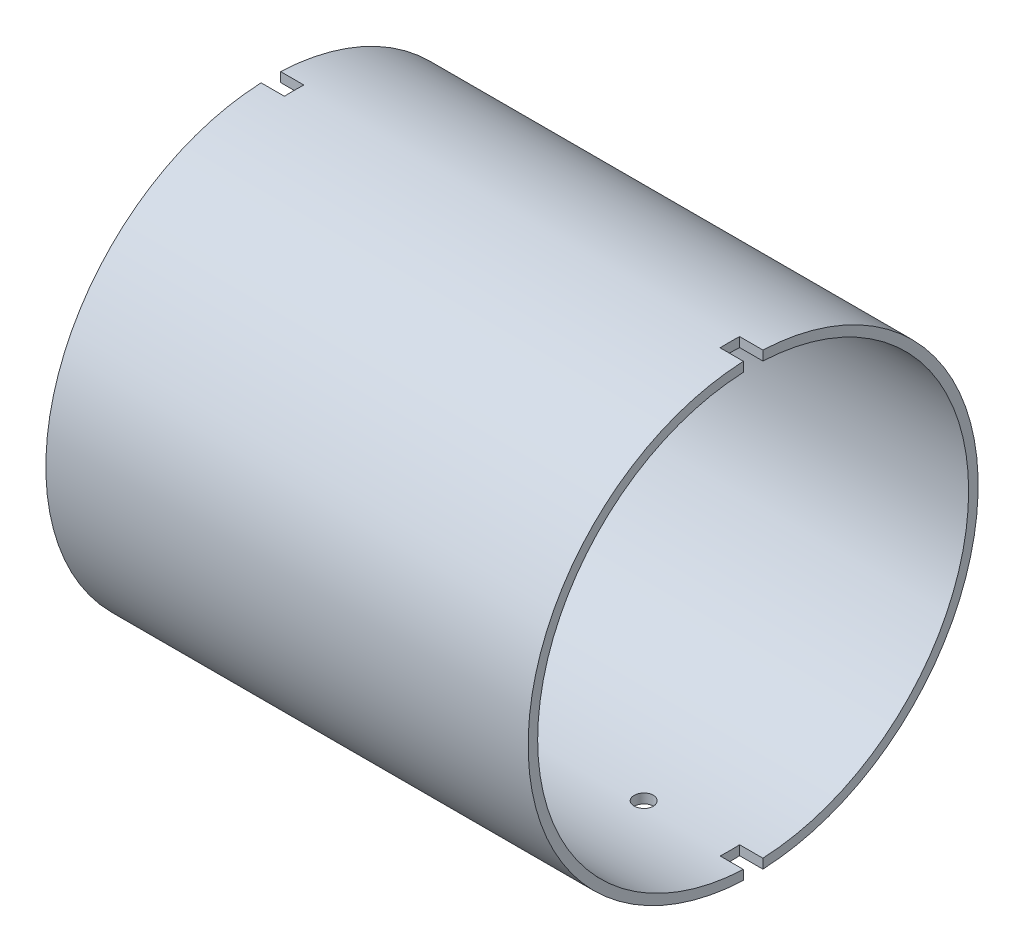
ISO-10303-21;
HEADER;
FILE_DESCRIPTION(('STEP AP214'),'2;1');
FILE_NAME('part.step','',(''),(''),'','','');
FILE_SCHEMA(('AUTOMOTIVE_DESIGN { 1 0 10303 214 1 1 1 1 }'));
ENDSEC;
DATA;
#1=APPLICATION_CONTEXT('core data for automotive mechanical design processes');
#2=APPLICATION_PROTOCOL_DEFINITION('international standard','automotive_design',2000,#1);
#3=PRODUCT_CONTEXT('',#1,'mechanical');
#4=PRODUCT('Part','Part','',(#3));
#5=PRODUCT_RELATED_PRODUCT_CATEGORY('part','',(#4));
#6=PRODUCT_DEFINITION_FORMATION('','',#4);
#7=PRODUCT_DEFINITION_CONTEXT('part definition',#1,'design');
#8=PRODUCT_DEFINITION('design','',#6,#7);
#9=PRODUCT_DEFINITION_SHAPE('','',#8);
#10=(LENGTH_UNIT() NAMED_UNIT(*) SI_UNIT(.MILLI.,.METRE.));
#11=(NAMED_UNIT(*) PLANE_ANGLE_UNIT() SI_UNIT($,.RADIAN.));
#12=(NAMED_UNIT(*) SI_UNIT($,.STERADIAN.) SOLID_ANGLE_UNIT());
#13=UNCERTAINTY_MEASURE_WITH_UNIT(LENGTH_MEASURE(1.E-05),#10,'distance_accuracy_value','');
#14=(GEOMETRIC_REPRESENTATION_CONTEXT(3) GLOBAL_UNCERTAINTY_ASSIGNED_CONTEXT((#13)) GLOBAL_UNIT_ASSIGNED_CONTEXT((#10,
#11,#12)) REPRESENTATION_CONTEXT('',''));
#15=CARTESIAN_POINT('',(0.,0.,0.));
#16=DIRECTION('',(0.,0.,1.));
#17=DIRECTION('',(1.,0.,0.));
#18=AXIS2_PLACEMENT_3D('',#15,#16,#17);
#19=CARTESIAN_POINT('',(0.,0.,0.));
#20=DIRECTION('',(1.,0.,0.));
#21=DIRECTION('',(0.,0.,-1.));
#22=AXIS2_PLACEMENT_3D('',#19,#20,#21);
#23=CYLINDRICAL_SURFACE('',#22,35.941);
#24=CARTESIAN_POINT('',(62.1792,-35.905923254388,-1.5875));
#25=CARTESIAN_POINT('',(62.2683238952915,-35.9059237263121,-1.58749606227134));
#26=CARTESIAN_POINT('',(62.3575113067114,-35.9062586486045,-1.57996953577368));
#27=CARTESIAN_POINT('',(62.5334266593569,-35.9075624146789,-1.55005096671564));
#28=CARTESIAN_POINT('',(62.6201515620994,-35.9085320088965,-1.52764132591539));
#29=CARTESIAN_POINT('',(62.7885680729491,-35.910995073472,-1.46859859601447));
#30=CARTESIAN_POINT('',(62.8702621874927,-35.9124882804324,-1.43197265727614));
#31=CARTESIAN_POINT('',(63.0263203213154,-35.9158299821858,-1.34554774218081));
#32=CARTESIAN_POINT('',(63.1006860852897,-35.9176783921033,-1.29575191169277));
#33=CARTESIAN_POINT('',(63.2400600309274,-35.9215239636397,-1.18435471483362));
#34=CARTESIAN_POINT('',(63.3050614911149,-35.9235212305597,-1.1227449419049));
#35=CARTESIAN_POINT('',(63.4238045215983,-35.9274384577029,-0.989485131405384));
#36=CARTESIAN_POINT('',(63.4775456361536,-35.9293584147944,-0.917834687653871));
#37=CARTESIAN_POINT('',(63.5722593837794,-35.9329053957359,-0.766494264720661));
#38=CARTESIAN_POINT('',(63.6132270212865,-35.9345323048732,-0.686801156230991));
#39=CARTESIAN_POINT('',(63.6811987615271,-35.9373088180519,-0.521659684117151));
#40=CARTESIAN_POINT('',(63.7082029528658,-35.938458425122,-0.436211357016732));
#41=CARTESIAN_POINT('',(63.7474641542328,-35.9401500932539,-0.262044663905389));
#42=CARTESIAN_POINT('',(63.7597308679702,-35.9406925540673,-0.173328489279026));
#43=CARTESIAN_POINT('',(63.7691988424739,-35.9411101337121,0.00490534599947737));
#44=CARTESIAN_POINT('',(63.7664002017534,-35.9409852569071,0.0944230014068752));
#45=CARTESIAN_POINT('',(63.7458249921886,-35.9400825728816,0.271653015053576));
#46=CARTESIAN_POINT('',(63.7280588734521,-35.9393052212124,0.359366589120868));
#47=CARTESIAN_POINT('',(63.6780692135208,-35.937185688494,0.530565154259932));
#48=CARTESIAN_POINT('',(63.6458456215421,-35.9358435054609,0.614050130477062));
#49=CARTESIAN_POINT('',(63.567843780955,-35.932744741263,0.77445533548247));
#50=CARTESIAN_POINT('',(63.5220607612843,-35.9309880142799,0.851373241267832));
#51=CARTESIAN_POINT('',(63.4182431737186,-35.9272580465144,0.996435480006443));
#52=CARTESIAN_POINT('',(63.3602085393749,-35.9252848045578,1.06457976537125));
#53=CARTESIAN_POINT('',(63.2334760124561,-35.9213420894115,1.19022132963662));
#54=CARTESIAN_POINT('',(63.1647690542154,-35.9193726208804,1.24770946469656));
#55=CARTESIAN_POINT('',(63.0186741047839,-35.9156611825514,1.35033642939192));
#56=CARTESIAN_POINT('',(62.9412861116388,-35.9139192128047,1.3954752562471));
#57=CARTESIAN_POINT('',(62.7800204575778,-35.9108593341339,1.47212141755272));
#58=CARTESIAN_POINT('',(62.696142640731,-35.9095414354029,1.50362842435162));
#59=CARTESIAN_POINT('',(62.5242807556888,-35.9074787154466,1.55211054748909));
#60=CARTESIAN_POINT('',(62.4362967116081,-35.9067338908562,1.56908574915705));
#61=CARTESIAN_POINT('',(62.2587995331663,-35.9059019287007,1.58801112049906));
#62=CARTESIAN_POINT('',(62.1692877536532,-35.9058142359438,1.58997397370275));
#63=CARTESIAN_POINT('',(61.9912060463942,-35.9063049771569,1.57885201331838));
#64=CARTESIAN_POINT('',(61.9026361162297,-35.9068834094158,1.56576723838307));
#65=CARTESIAN_POINT('',(61.728987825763,-35.9086406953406,1.52493196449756));
#66=CARTESIAN_POINT('',(61.6439081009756,-35.9098193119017,1.49718725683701));
#67=CARTESIAN_POINT('',(61.4796133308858,-35.9126439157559,1.42782555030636));
#68=CARTESIAN_POINT('',(61.4003983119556,-35.9142899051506,1.3862084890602));
#69=CARTESIAN_POINT('',(61.2500231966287,-35.9178650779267,1.29025082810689));
#70=CARTESIAN_POINT('',(61.1788685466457,-35.9197944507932,1.2359017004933));
#71=CARTESIAN_POINT('',(61.0466887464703,-35.9237182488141,1.11603515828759));
#72=CARTESIAN_POINT('',(60.9856636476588,-35.9257126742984,1.0505176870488));
#73=CARTESIAN_POINT('',(60.875432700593,-35.929543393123,0.910119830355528));
#74=CARTESIAN_POINT('',(60.8262350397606,-35.9313795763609,0.835233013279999));
#75=CARTESIAN_POINT('',(60.7411114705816,-35.9346852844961,0.678254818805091));
#76=CARTESIAN_POINT('',(60.7051855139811,-35.9361548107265,0.596163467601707));
#77=CARTESIAN_POINT('',(60.6476394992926,-35.9385610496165,0.427137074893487));
#78=CARTESIAN_POINT('',(60.6260141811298,-35.9394979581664,0.340203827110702));
#79=CARTESIAN_POINT('',(60.5976660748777,-35.9407341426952,0.163936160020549));
#80=CARTESIAN_POINT('',(60.5909432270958,-35.9410334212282,0.0746017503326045));
#81=CARTESIAN_POINT('',(60.5925915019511,-35.9409606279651,-0.103850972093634));
#82=CARTESIAN_POINT('',(60.6009497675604,-35.9405891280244,-0.192969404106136));
#83=CARTESIAN_POINT('',(60.6324964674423,-35.9392177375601,-0.36853657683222));
#84=CARTESIAN_POINT('',(60.6556849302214,-35.9382178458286,-0.454985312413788));
#85=CARTESIAN_POINT('',(60.7162313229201,-35.9357022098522,-0.622762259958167));
#86=CARTESIAN_POINT('',(60.7535894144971,-35.934186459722,-0.704090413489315));
#87=CARTESIAN_POINT('',(60.8414120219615,-35.9308096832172,-0.859320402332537));
#88=CARTESIAN_POINT('',(60.8918761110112,-35.9289486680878,-0.933222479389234));
#89=CARTESIAN_POINT('',(61.0045229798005,-35.9250891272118,-1.07156592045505));
#90=CARTESIAN_POINT('',(61.0667144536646,-35.9230905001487,-1.13600020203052));
#91=CARTESIAN_POINT('',(61.2010500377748,-35.9191815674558,-1.25353284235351));
#92=CARTESIAN_POINT('',(61.2731965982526,-35.9172712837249,-1.30662840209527));
#93=CARTESIAN_POINT('',(61.4254412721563,-35.9137534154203,-1.39999582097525));
#94=CARTESIAN_POINT('',(61.5055461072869,-35.9121460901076,-1.44025671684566));
#95=CARTESIAN_POINT('',(61.6713248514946,-35.9094196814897,-1.50671022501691));
#96=CARTESIAN_POINT('',(61.7569920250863,-35.9083000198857,-1.53291950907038));
#97=CARTESIAN_POINT('',(61.8991954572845,-35.9069726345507,-1.56362663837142));
#98=CARTESIAN_POINT('',(61.9548099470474,-35.9065808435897,-1.57256777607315));
#99=CARTESIAN_POINT('',(62.066674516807,-35.9060560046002,-1.58450569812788));
#100=CARTESIAN_POINT('',(62.1229245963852,-35.9059229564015,-1.5875024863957));
#101=CARTESIAN_POINT('',(62.1792,-35.905923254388,-1.5875));
#102=B_SPLINE_CURVE_WITH_KNOTS('',3,(#24,#25,#26,#27,#28,#29,#30,#31,#32,#33,#34,#35,#36,#37,
#38,#39,#40,#41,#42,#43,#44,#45,#46,#47,#48,#49,#50,#51,#52,#53,#54,#55,#56,#57,#58,#59,#60,#61,
#62,#63,#64,#65,#66,#67,#68,#69,#70,#71,#72,#73,#74,#75,#76,#77,#78,#79,#80,#81,#82,#83,#84,#85,
#86,#87,#88,#89,#90,#91,#92,#93,#94,#95,#96,#97,#98,#99,#100,#101),.UNSPECIFIED.,.T.,.F.,(4,2,2,
2,2,2,2,2,2,2,2,2,2,2,2,2,2,2,2,2,2,2,2,2,2,2,2,2,2,2,2,2,2,2,2,2,2,2,4),(0.,0.267166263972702,
0.534648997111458,0.801997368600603,1.06928193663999,1.33675740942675,1.6042437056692,
1.87183448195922,2.13942356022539,2.40683635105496,2.6742473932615,2.94147188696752,
3.20869731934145,3.47601689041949,3.74333791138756,4.01088726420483,4.27843667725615,
4.54599252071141,4.81354679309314,5.08087499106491,5.34820250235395,5.6154244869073,
5.88264767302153,6.15005035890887,6.41745440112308,6.68504302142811,6.95263066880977,
7.220119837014,7.48760793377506,7.75486809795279,8.02212877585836,8.28939250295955,
8.55664752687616,8.82410146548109,9.09162134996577,9.35936913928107,9.62679854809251,
9.79549516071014,9.96419166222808),.UNSPECIFIED.);
#103=CARTESIAN_POINT('',(62.1792,-35.905923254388,-1.5875));
#104=VERTEX_POINT('',#103);
#105=EDGE_CURVE('E232',#104,#104,#102,.T.);
#106=ORIENTED_EDGE('',*,*,#105,.T.);
#107=EDGE_LOOP('',(#106));
#108=FACE_BOUND('',#107,.T.);
#109=CARTESIAN_POINT('',(18.4912,-35.905923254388,-1.5875));
#110=CARTESIAN_POINT('',(18.5803238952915,-35.9059237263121,-1.58749606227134));
#111=CARTESIAN_POINT('',(18.6695113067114,-35.9062586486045,-1.57996953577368));
#112=CARTESIAN_POINT('',(18.8454266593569,-35.9075624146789,-1.55005096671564));
#113=CARTESIAN_POINT('',(18.9321515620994,-35.9085320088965,-1.52764132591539));
#114=CARTESIAN_POINT('',(19.1005680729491,-35.910995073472,-1.46859859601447));
#115=CARTESIAN_POINT('',(19.1822621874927,-35.9124882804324,-1.43197265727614));
#116=CARTESIAN_POINT('',(19.3383203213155,-35.9158299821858,-1.34554774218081));
#117=CARTESIAN_POINT('',(19.4126860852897,-35.9176783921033,-1.29575191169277));
#118=CARTESIAN_POINT('',(19.5520600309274,-35.9215239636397,-1.18435471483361));
#119=CARTESIAN_POINT('',(19.6170614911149,-35.9235212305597,-1.1227449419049));
#120=CARTESIAN_POINT('',(19.7358045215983,-35.9274384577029,-0.989485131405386));
#121=CARTESIAN_POINT('',(19.7895456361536,-35.9293584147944,-0.917834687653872));
#122=CARTESIAN_POINT('',(19.8842593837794,-35.9329053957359,-0.766494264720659));
#123=CARTESIAN_POINT('',(19.9252270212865,-35.9345323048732,-0.686801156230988));
#124=CARTESIAN_POINT('',(19.9931987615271,-35.9373088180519,-0.521659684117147));
#125=CARTESIAN_POINT('',(20.0202029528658,-35.938458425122,-0.436211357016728));
#126=CARTESIAN_POINT('',(20.0594641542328,-35.9401500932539,-0.262044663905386));
#127=CARTESIAN_POINT('',(20.0717308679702,-35.9406925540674,-0.173328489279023));
#128=CARTESIAN_POINT('',(20.081198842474,-35.9411101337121,0.0049053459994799));
#129=CARTESIAN_POINT('',(20.0784002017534,-35.9409852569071,0.0944230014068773));
#130=CARTESIAN_POINT('',(20.0578249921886,-35.9400825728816,0.271653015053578));
#131=CARTESIAN_POINT('',(20.0400588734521,-35.9393052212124,0.35936658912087));
#132=CARTESIAN_POINT('',(19.9900692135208,-35.937185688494,0.530565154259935));
#133=CARTESIAN_POINT('',(19.9578456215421,-35.9358435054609,0.614050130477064));
#134=CARTESIAN_POINT('',(19.879843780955,-35.932744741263,0.774455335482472));
#135=CARTESIAN_POINT('',(19.8340607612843,-35.9309880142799,0.851373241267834));
#136=CARTESIAN_POINT('',(19.7302431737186,-35.9272580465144,0.996435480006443));
#137=CARTESIAN_POINT('',(19.6722085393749,-35.9252848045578,1.06457976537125));
#138=CARTESIAN_POINT('',(19.5454760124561,-35.9213420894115,1.19022132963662));
#139=CARTESIAN_POINT('',(19.4767690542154,-35.9193726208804,1.24770946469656));
#140=CARTESIAN_POINT('',(19.3306741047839,-35.9156611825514,1.35033642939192));
#141=CARTESIAN_POINT('',(19.2532861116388,-35.9139192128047,1.3954752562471));
#142=CARTESIAN_POINT('',(19.0920204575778,-35.9108593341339,1.47212141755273));
#143=CARTESIAN_POINT('',(19.008142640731,-35.9095414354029,1.50362842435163));
#144=CARTESIAN_POINT('',(18.8362807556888,-35.9074787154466,1.55211054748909));
#145=CARTESIAN_POINT('',(18.7482967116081,-35.9067338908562,1.56908574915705));
#146=CARTESIAN_POINT('',(18.5707995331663,-35.9059019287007,1.58801112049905));
#147=CARTESIAN_POINT('',(18.4812877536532,-35.9058142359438,1.58997397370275));
#148=CARTESIAN_POINT('',(18.3032060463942,-35.9063049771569,1.57885201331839));
#149=CARTESIAN_POINT('',(18.2146361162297,-35.9068834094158,1.56576723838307));
#150=CARTESIAN_POINT('',(18.0409878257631,-35.9086406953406,1.52493196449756));
#151=CARTESIAN_POINT('',(17.9559081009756,-35.9098193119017,1.49718725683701));
#152=CARTESIAN_POINT('',(17.7916133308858,-35.9126439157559,1.42782555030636));
#153=CARTESIAN_POINT('',(17.7123983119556,-35.9142899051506,1.3862084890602));
#154=CARTESIAN_POINT('',(17.5620231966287,-35.9178650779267,1.29025082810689));
#155=CARTESIAN_POINT('',(17.4908685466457,-35.9197944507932,1.2359017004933));
#156=CARTESIAN_POINT('',(17.3586887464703,-35.9237182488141,1.1160351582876));
#157=CARTESIAN_POINT('',(17.2976636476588,-35.9257126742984,1.05051768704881));
#158=CARTESIAN_POINT('',(17.187432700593,-35.929543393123,0.910119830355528));
#159=CARTESIAN_POINT('',(17.1382350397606,-35.9313795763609,0.835233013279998));
#160=CARTESIAN_POINT('',(17.0531114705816,-35.9346852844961,0.67825481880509));
#161=CARTESIAN_POINT('',(17.0171855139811,-35.9361548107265,0.596163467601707));
#162=CARTESIAN_POINT('',(16.9596394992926,-35.9385610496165,0.427137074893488));
#163=CARTESIAN_POINT('',(16.9380141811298,-35.9394979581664,0.340203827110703));
#164=CARTESIAN_POINT('',(16.9096660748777,-35.9407341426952,0.163936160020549));
#165=CARTESIAN_POINT('',(16.9029432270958,-35.9410334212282,0.0746017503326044));
#166=CARTESIAN_POINT('',(16.9045915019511,-35.9409606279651,-0.103850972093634));
#167=CARTESIAN_POINT('',(16.9129497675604,-35.9405891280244,-0.192969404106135));
#168=CARTESIAN_POINT('',(16.9444964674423,-35.9392177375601,-0.36853657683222));
#169=CARTESIAN_POINT('',(16.9676849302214,-35.9382178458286,-0.454985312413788));
#170=CARTESIAN_POINT('',(17.0282313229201,-35.9357022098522,-0.622762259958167));
#171=CARTESIAN_POINT('',(17.0655894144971,-35.934186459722,-0.704090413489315));
#172=CARTESIAN_POINT('',(17.1534120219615,-35.9308096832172,-0.859320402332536));
#173=CARTESIAN_POINT('',(17.2038761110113,-35.9289486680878,-0.933222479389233));
#174=CARTESIAN_POINT('',(17.3165229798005,-35.9250891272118,-1.07156592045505));
#175=CARTESIAN_POINT('',(17.3787144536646,-35.9230905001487,-1.13600020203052));
#176=CARTESIAN_POINT('',(17.5130500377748,-35.9191815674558,-1.25353284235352));
#177=CARTESIAN_POINT('',(17.5851965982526,-35.9172712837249,-1.30662840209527));
#178=CARTESIAN_POINT('',(17.7374412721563,-35.9137534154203,-1.39999582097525));
#179=CARTESIAN_POINT('',(17.8175461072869,-35.9121460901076,-1.44025671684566));
#180=CARTESIAN_POINT('',(17.9833248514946,-35.9094196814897,-1.50671022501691));
#181=CARTESIAN_POINT('',(18.0689920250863,-35.9083000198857,-1.53291950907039));
#182=CARTESIAN_POINT('',(18.2111954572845,-35.9069726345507,-1.56362663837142));
#183=CARTESIAN_POINT('',(18.2668099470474,-35.9065808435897,-1.57256777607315));
#184=CARTESIAN_POINT('',(18.378674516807,-35.9060560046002,-1.58450569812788));
#185=CARTESIAN_POINT('',(18.4349245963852,-35.9059229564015,-1.5875024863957));
#186=CARTESIAN_POINT('',(18.4912,-35.905923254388,-1.5875));
#187=B_SPLINE_CURVE_WITH_KNOTS('',3,(#109,#110,#111,#112,#113,#114,#115,#116,#117,#118,#119,
#120,#121,#122,#123,#124,#125,#126,#127,#128,#129,#130,#131,#132,#133,#134,#135,#136,#137,#138,
#139,#140,#141,#142,#143,#144,#145,#146,#147,#148,#149,#150,#151,#152,#153,#154,#155,#156,#157,
#158,#159,#160,#161,#162,#163,#164,#165,#166,#167,#168,#169,#170,#171,#172,#173,#174,#175,#176,
#177,#178,#179,#180,#181,#182,#183,#184,#185,#186),.UNSPECIFIED.,.T.,.F.,(4,2,2,2,2,2,2,2,2,2,2,
2,2,2,2,2,2,2,2,2,2,2,2,2,2,2,2,2,2,2,2,2,2,2,2,2,2,2,4),(0.,0.267166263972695,
0.534648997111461,0.801997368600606,1.06928193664,1.33675740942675,1.60424370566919,
1.87183448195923,2.13942356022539,2.40683635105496,2.6742473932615,2.94147188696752,
3.20869731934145,3.47601689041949,3.74333791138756,4.01088726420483,4.27843667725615,
4.54599252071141,4.81354679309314,5.08087499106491,5.34820250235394,5.61542448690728,
5.88264767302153,6.15005035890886,6.41745440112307,6.6850430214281,6.95263066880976,
7.220119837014,7.48760793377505,7.75486809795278,8.02212877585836,8.28939250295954,
8.55664752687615,8.82410146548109,9.09162134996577,9.35936913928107,9.62679854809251,
9.79549516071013,9.96419166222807),.UNSPECIFIED.);
#188=CARTESIAN_POINT('',(18.4912,-35.905923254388,-1.5875));
#189=VERTEX_POINT('',#188);
#190=EDGE_CURVE('E252',#189,#189,#187,.T.);
#191=ORIENTED_EDGE('',*,*,#190,.T.);
#192=EDGE_LOOP('',(#191));
#193=FACE_BOUND('',#192,.T.);
#194=CARTESIAN_POINT('',(0.,0.,0.));
#195=DIRECTION('',(1.,0.,0.));
#196=DIRECTION('',(0.,0.,-1.));
#197=AXIS2_PLACEMENT_3D('',#194,#195,#196);
#198=CIRCLE('',#197,35.941);
#199=CARTESIAN_POINT('',(0.,35.9042184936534,-1.6256));
#200=VERTEX_POINT('',#199);
#201=CARTESIAN_POINT('',(0.,-35.9042184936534,-1.6256));
#202=VERTEX_POINT('',#201);
#203=EDGE_CURVE('E234',#200,#202,#198,.F.);
#204=ORIENTED_EDGE('',*,*,#203,.T.);
#205=DIRECTION('',(-1.,0.,0.));
#206=VECTOR('',#205,1.);
#207=CARTESIAN_POINT('',(1.9431,-35.9042184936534,-1.6256));
#208=LINE('',#207,#206);
#209=CARTESIAN_POINT('',(3.8862,-35.9042184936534,-1.6256));
#210=VERTEX_POINT('',#209);
#211=EDGE_CURVE('E170',#202,#210,#208,.F.);
#212=ORIENTED_EDGE('',*,*,#211,.T.);
#213=CARTESIAN_POINT('',(3.8862,0.,0.));
#214=DIRECTION('',(1.,0.,0.));
#215=DIRECTION('',(0.,0.,-1.));
#216=AXIS2_PLACEMENT_3D('',#213,#214,#215);
#217=CIRCLE('',#216,35.941);
#218=CARTESIAN_POINT('',(3.8862,-35.9042184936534,1.6256));
#219=VERTEX_POINT('',#218);
#220=EDGE_CURVE('E236',#210,#219,#217,.F.);
#221=ORIENTED_EDGE('',*,*,#220,.T.);
#222=DIRECTION('',(1.,0.,0.));
#223=VECTOR('',#222,1.);
#224=CARTESIAN_POINT('',(1.9431,-35.9042184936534,1.6256));
#225=LINE('',#224,#223);
#226=CARTESIAN_POINT('',(0.,-35.9042184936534,1.6256));
#227=VERTEX_POINT('',#226);
#228=EDGE_CURVE('E174',#219,#227,#225,.F.);
#229=ORIENTED_EDGE('',*,*,#228,.T.);
#230=CARTESIAN_POINT('',(0.,0.,0.));
#231=DIRECTION('',(1.,0.,0.));
#232=DIRECTION('',(0.,0.,-1.));
#233=AXIS2_PLACEMENT_3D('',#230,#231,#232);
#234=CIRCLE('',#233,35.941);
#235=CARTESIAN_POINT('',(0.,35.9042184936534,1.6256));
#236=VERTEX_POINT('',#235);
#237=EDGE_CURVE('E240',#227,#236,#234,.F.);
#238=ORIENTED_EDGE('',*,*,#237,.T.);
#239=DIRECTION('',(1.,0.,0.));
#240=VECTOR('',#239,1.);
#241=CARTESIAN_POINT('',(1.9431,35.9042184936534,1.6256));
#242=LINE('',#241,#240);
#243=CARTESIAN_POINT('',(3.8862,35.9042184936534,1.6256));
#244=VERTEX_POINT('',#243);
#245=EDGE_CURVE('E128',#236,#244,#242,.T.);
#246=ORIENTED_EDGE('',*,*,#245,.T.);
#247=CARTESIAN_POINT('',(3.8862,0.,0.));
#248=DIRECTION('',(1.,0.,0.));
#249=DIRECTION('',(0.,0.,-1.));
#250=AXIS2_PLACEMENT_3D('',#247,#248,#249);
#251=CIRCLE('',#250,35.941);
#252=CARTESIAN_POINT('',(3.8862,35.9042184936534,-1.6256));
#253=VERTEX_POINT('',#252);
#254=EDGE_CURVE('E21',#244,#253,#251,.F.);
#255=ORIENTED_EDGE('',*,*,#254,.T.);
#256=DIRECTION('',(-1.,0.,0.));
#257=VECTOR('',#256,1.);
#258=CARTESIAN_POINT('',(1.9431,35.9042184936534,-1.6256));
#259=LINE('',#258,#257);
#260=EDGE_CURVE('E132',#253,#200,#259,.T.);
#261=ORIENTED_EDGE('',*,*,#260,.T.);
#262=EDGE_LOOP('',(#204,#212,#221,#229,#238,#246,#255,#261));
#263=FACE_BOUND('',#262,.T.);
#264=CARTESIAN_POINT('',(80.4418,0.,0.));
#265=DIRECTION('',(1.,0.,0.));
#266=DIRECTION('',(0.,0.,-1.));
#267=AXIS2_PLACEMENT_3D('',#264,#265,#266);
#268=CIRCLE('',#267,35.941);
#269=CARTESIAN_POINT('',(80.4418,-35.9042184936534,1.6256));
#270=VERTEX_POINT('',#269);
#271=CARTESIAN_POINT('',(80.4418,35.9042184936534,1.6256));
#272=VERTEX_POINT('',#271);
#273=EDGE_CURVE('E257',#270,#272,#268,.F.);
#274=ORIENTED_EDGE('',*,*,#273,.F.);
#275=DIRECTION('',(1.,0.,0.));
#276=VECTOR('',#275,1.);
#277=CARTESIAN_POINT('',(78.4987,-35.9042184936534,1.6256));
#278=LINE('',#277,#276);
#279=CARTESIAN_POINT('',(76.5556,-35.9042184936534,1.6256));
#280=VERTEX_POINT('',#279);
#281=EDGE_CURVE('E155',#270,#280,#278,.F.);
#282=ORIENTED_EDGE('',*,*,#281,.T.);
#283=CARTESIAN_POINT('',(76.5556,0.,0.));
#284=DIRECTION('',(1.,0.,0.));
#285=DIRECTION('',(0.,0.,-1.));
#286=AXIS2_PLACEMENT_3D('',#283,#284,#285);
#287=CIRCLE('',#286,35.941);
#288=CARTESIAN_POINT('',(76.5556,-35.9042184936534,-1.6256));
#289=VERTEX_POINT('',#288);
#290=EDGE_CURVE('E460',#280,#289,#287,.T.);
#291=ORIENTED_EDGE('',*,*,#290,.T.);
#292=DIRECTION('',(-1.,0.,0.));
#293=VECTOR('',#292,1.);
#294=CARTESIAN_POINT('',(78.4987,-35.9042184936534,-1.6256));
#295=LINE('',#294,#293);
#296=CARTESIAN_POINT('',(80.4418,-35.9042184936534,-1.6256));
#297=VERTEX_POINT('',#296);
#298=EDGE_CURVE('E162',#289,#297,#295,.F.);
#299=ORIENTED_EDGE('',*,*,#298,.T.);
#300=CARTESIAN_POINT('',(80.4418,0.,0.));
#301=DIRECTION('',(1.,0.,0.));
#302=DIRECTION('',(0.,0.,-1.));
#303=AXIS2_PLACEMENT_3D('',#300,#301,#302);
#304=CIRCLE('',#303,35.941);
#305=CARTESIAN_POINT('',(80.4418,35.9042184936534,-1.6256));
#306=VERTEX_POINT('',#305);
#307=EDGE_CURVE('E165',#306,#297,#304,.F.);
#308=ORIENTED_EDGE('',*,*,#307,.F.);
#309=DIRECTION('',(-1.,0.,0.));
#310=VECTOR('',#309,1.);
#311=CARTESIAN_POINT('',(78.4987,35.9042184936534,-1.6256));
#312=LINE('',#311,#310);
#313=CARTESIAN_POINT('',(76.5556,35.9042184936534,-1.6256));
#314=VERTEX_POINT('',#313);
#315=EDGE_CURVE('E166',#306,#314,#312,.T.);
#316=ORIENTED_EDGE('',*,*,#315,.T.);
#317=CARTESIAN_POINT('',(76.5556,0.,0.));
#318=DIRECTION('',(1.,0.,0.));
#319=DIRECTION('',(0.,0.,-1.));
#320=AXIS2_PLACEMENT_3D('',#317,#318,#319);
#321=CIRCLE('',#320,35.941);
#322=CARTESIAN_POINT('',(76.5556,35.9042184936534,1.6256));
#323=VERTEX_POINT('',#322);
#324=EDGE_CURVE('E161',#314,#323,#321,.T.);
#325=ORIENTED_EDGE('',*,*,#324,.T.);
#326=DIRECTION('',(1.,0.,0.));
#327=VECTOR('',#326,1.);
#328=CARTESIAN_POINT('',(78.4987,35.9042184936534,1.6256));
#329=LINE('',#328,#327);
#330=EDGE_CURVE('E159',#323,#272,#329,.T.);
#331=ORIENTED_EDGE('',*,*,#330,.T.);
#332=EDGE_LOOP('',(#274,#282,#291,#299,#308,#316,#325,#331));
#333=FACE_BOUND('',#332,.T.);
#334=ADVANCED_FACE('F17',(#108,#193,#263,#333),#23,.F.);
#335=CARTESIAN_POINT('',(1.9431,-133.184044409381,-1.6256));
#336=DIRECTION('',(0.,0.,-1.));
#337=DIRECTION('',(-1.,0.,0.));
#338=AXIS2_PLACEMENT_3D('',#335,#336,#337);
#339=PLANE('',#338);
#340=DIRECTION('',(0.,1.,0.));
#341=VECTOR('',#340,1.);
#342=CARTESIAN_POINT('',(0.,0.,-1.6256));
#343=LINE('',#342,#341);
#344=CARTESIAN_POINT('',(0.,37.4932758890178,-1.6256));
#345=VERTEX_POINT('',#344);
#346=EDGE_CURVE('E142',#345,#200,#343,.F.);
#347=ORIENTED_EDGE('',*,*,#346,.T.);
#348=ORIENTED_EDGE('',*,*,#260,.F.);
#349=DIRECTION('',(0.,1.,0.));
#350=VECTOR('',#349,1.);
#351=CARTESIAN_POINT('',(3.8862,-133.184044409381,-1.6256));
#352=LINE('',#351,#350);
#353=CARTESIAN_POINT('',(3.8862,37.4932758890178,-1.6256));
#354=VERTEX_POINT('',#353);
#355=EDGE_CURVE('E137',#253,#354,#352,.T.);
#356=ORIENTED_EDGE('',*,*,#355,.T.);
#357=DIRECTION('',(1.,0.,0.));
#358=VECTOR('',#357,1.);
#359=CARTESIAN_POINT('',(0.,37.4932758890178,-1.6256));
#360=LINE('',#359,#358);
#361=EDGE_CURVE('E230',#345,#354,#360,.T.);
#362=ORIENTED_EDGE('',*,*,#361,.F.);
#363=EDGE_LOOP('',(#347,#348,#356,#362));
#364=FACE_BOUND('',#363,.T.);
#365=ADVANCED_FACE('F139',(#364),#339,.F.);
#366=CARTESIAN_POINT('',(3.8862,-133.184044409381,0.));
#367=DIRECTION('',(1.,0.,0.));
#368=DIRECTION('',(0.,0.,-1.));
#369=AXIS2_PLACEMENT_3D('',#366,#367,#368);
#370=PLANE('',#369);
#371=ORIENTED_EDGE('',*,*,#355,.F.);
#372=ORIENTED_EDGE('',*,*,#254,.F.);
#373=DIRECTION('',(0.,1.,0.));
#374=VECTOR('',#373,1.);
#375=CARTESIAN_POINT('',(3.8862,-133.184044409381,1.6256));
#376=LINE('',#375,#374);
#377=CARTESIAN_POINT('',(3.8862,37.4932758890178,1.6256));
#378=VERTEX_POINT('',#377);
#379=EDGE_CURVE('E150',#244,#378,#376,.T.);
#380=ORIENTED_EDGE('',*,*,#379,.T.);
#381=CARTESIAN_POINT('',(3.8862,0.,0.));
#382=DIRECTION('',(1.,0.,0.));
#383=DIRECTION('',(0.,0.,-1.));
#384=AXIS2_PLACEMENT_3D('',#381,#382,#383);
#385=CIRCLE('',#384,37.5285);
#386=EDGE_CURVE('E147',#354,#378,#385,.T.);
#387=ORIENTED_EDGE('',*,*,#386,.F.);
#388=EDGE_LOOP('',(#371,#372,#380,#387));
#389=FACE_BOUND('',#388,.T.);
#390=ADVANCED_FACE('F145',(#389),#370,.F.);
#391=CARTESIAN_POINT('',(1.9431,-133.184044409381,1.6256));
#392=DIRECTION('',(0.,0.,1.));
#393=DIRECTION('',(1.,0.,0.));
#394=AXIS2_PLACEMENT_3D('',#391,#392,#393);
#395=PLANE('',#394);
#396=ORIENTED_EDGE('',*,*,#379,.F.);
#397=ORIENTED_EDGE('',*,*,#245,.F.);
#398=DIRECTION('',(0.,1.,0.));
#399=VECTOR('',#398,1.);
#400=CARTESIAN_POINT('',(0.,0.,1.6256));
#401=LINE('',#400,#399);
#402=CARTESIAN_POINT('',(0.,37.4932758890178,1.6256));
#403=VERTEX_POINT('',#402);
#404=EDGE_CURVE('E176',#236,#403,#401,.T.);
#405=ORIENTED_EDGE('',*,*,#404,.T.);
#406=DIRECTION('',(1.,0.,0.));
#407=VECTOR('',#406,1.);
#408=CARTESIAN_POINT('',(0.,37.4932758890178,1.6256));
#409=LINE('',#408,#407);
#410=EDGE_CURVE('E241',#378,#403,#409,.F.);
#411=ORIENTED_EDGE('',*,*,#410,.F.);
#412=EDGE_LOOP('',(#396,#397,#405,#411));
#413=FACE_BOUND('',#412,.T.);
#414=ADVANCED_FACE('F313',(#413),#395,.F.);
#415=CARTESIAN_POINT('',(0.,0.,0.));
#416=DIRECTION('',(1.,0.,0.));
#417=DIRECTION('',(0.,0.,-1.));
#418=AXIS2_PLACEMENT_3D('',#415,#416,#417);
#419=PLANE('',#418);
#420=ORIENTED_EDGE('',*,*,#237,.F.);
#421=DIRECTION('',(0.,1.,0.));
#422=VECTOR('',#421,1.);
#423=CARTESIAN_POINT('',(0.,-133.184044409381,1.6256));
#424=LINE('',#423,#422);
#425=CARTESIAN_POINT('',(0.,-37.4932758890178,1.6256));
#426=VERTEX_POINT('',#425);
#427=EDGE_CURVE('E175',#227,#426,#424,.F.);
#428=ORIENTED_EDGE('',*,*,#427,.T.);
#429=CARTESIAN_POINT('',(0.,0.,0.));
#430=DIRECTION('',(1.,0.,0.));
#431=DIRECTION('',(0.,0.,-1.));
#432=AXIS2_PLACEMENT_3D('',#429,#430,#431);
#433=CIRCLE('',#432,37.5285);
#434=EDGE_CURVE('E238',#403,#426,#433,.T.);
#435=ORIENTED_EDGE('',*,*,#434,.F.);
#436=ORIENTED_EDGE('',*,*,#404,.F.);
#437=EDGE_LOOP('',(#420,#428,#435,#436));
#438=FACE_BOUND('',#437,.T.);
#439=ADVANCED_FACE('F309',(#438),#419,.F.);
#440=CARTESIAN_POINT('',(1.9431,-133.184044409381,1.6256));
#441=DIRECTION('',(0.,0.,1.));
#442=DIRECTION('',(1.,0.,0.));
#443=AXIS2_PLACEMENT_3D('',#440,#441,#442);
#444=PLANE('',#443);
#445=ORIENTED_EDGE('',*,*,#427,.F.);
#446=ORIENTED_EDGE('',*,*,#228,.F.);
#447=DIRECTION('',(0.,1.,0.));
#448=VECTOR('',#447,1.);
#449=CARTESIAN_POINT('',(3.8862,-133.184044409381,1.6256));
#450=LINE('',#449,#448);
#451=CARTESIAN_POINT('',(3.8862,-37.4932758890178,1.6256));
#452=VERTEX_POINT('',#451);
#453=EDGE_CURVE('E173',#219,#452,#450,.F.);
#454=ORIENTED_EDGE('',*,*,#453,.T.);
#455=DIRECTION('',(1.,0.,0.));
#456=VECTOR('',#455,1.);
#457=CARTESIAN_POINT('',(0.,-37.4932758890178,1.62560000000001));
#458=LINE('',#457,#456);
#459=EDGE_CURVE('E224',#426,#452,#458,.T.);
#460=ORIENTED_EDGE('',*,*,#459,.F.);
#461=EDGE_LOOP('',(#445,#446,#454,#460));
#462=FACE_BOUND('',#461,.T.);
#463=ADVANCED_FACE('F305',(#462),#444,.F.);
#464=CARTESIAN_POINT('',(3.8862,-133.184044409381,0.));
#465=DIRECTION('',(1.,0.,0.));
#466=DIRECTION('',(0.,0.,-1.));
#467=AXIS2_PLACEMENT_3D('',#464,#465,#466);
#468=PLANE('',#467);
#469=ORIENTED_EDGE('',*,*,#453,.F.);
#470=ORIENTED_EDGE('',*,*,#220,.F.);
#471=DIRECTION('',(0.,1.,0.));
#472=VECTOR('',#471,1.);
#473=CARTESIAN_POINT('',(3.8862,-133.184044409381,-1.6256));
#474=LINE('',#473,#472);
#475=CARTESIAN_POINT('',(3.8862,-37.4932758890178,-1.6256));
#476=VERTEX_POINT('',#475);
#477=EDGE_CURVE('E172',#210,#476,#474,.F.);
#478=ORIENTED_EDGE('',*,*,#477,.T.);
#479=CARTESIAN_POINT('',(3.8862,0.,0.));
#480=DIRECTION('',(1.,0.,0.));
#481=DIRECTION('',(0.,0.,-1.));
#482=AXIS2_PLACEMENT_3D('',#479,#480,#481);
#483=CIRCLE('',#482,37.5285);
#484=EDGE_CURVE('E218',#452,#476,#483,.T.);
#485=ORIENTED_EDGE('',*,*,#484,.F.);
#486=EDGE_LOOP('',(#469,#470,#478,#485));
#487=FACE_BOUND('',#486,.T.);
#488=ADVANCED_FACE('F302',(#487),#468,.F.);
#489=CARTESIAN_POINT('',(1.9431,-133.184044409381,-1.6256));
#490=DIRECTION('',(0.,0.,-1.));
#491=DIRECTION('',(-1.,0.,0.));
#492=AXIS2_PLACEMENT_3D('',#489,#490,#491);
#493=PLANE('',#492);
#494=ORIENTED_EDGE('',*,*,#477,.F.);
#495=ORIENTED_EDGE('',*,*,#211,.F.);
#496=DIRECTION('',(0.,1.,0.));
#497=VECTOR('',#496,1.);
#498=CARTESIAN_POINT('',(0.,0.,-1.6256));
#499=LINE('',#498,#497);
#500=CARTESIAN_POINT('',(0.,-37.4932758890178,-1.6256));
#501=VERTEX_POINT('',#500);
#502=EDGE_CURVE('E228',#202,#501,#499,.F.);
#503=ORIENTED_EDGE('',*,*,#502,.T.);
#504=DIRECTION('',(1.,0.,0.));
#505=VECTOR('',#504,1.);
#506=CARTESIAN_POINT('',(0.,-37.4932758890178,-1.62559999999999));
#507=LINE('',#506,#505);
#508=EDGE_CURVE('E213',#476,#501,#507,.F.);
#509=ORIENTED_EDGE('',*,*,#508,.F.);
#510=EDGE_LOOP('',(#494,#495,#503,#509));
#511=FACE_BOUND('',#510,.T.);
#512=ADVANCED_FACE('F298',(#511),#493,.F.);
#513=CARTESIAN_POINT('',(0.,0.,0.));
#514=DIRECTION('',(1.,0.,0.));
#515=DIRECTION('',(0.,0.,-1.));
#516=AXIS2_PLACEMENT_3D('',#513,#514,#515);
#517=PLANE('',#516);
#518=CARTESIAN_POINT('',(0.,0.,0.));
#519=DIRECTION('',(1.,0.,0.));
#520=DIRECTION('',(0.,0.,-1.));
#521=AXIS2_PLACEMENT_3D('',#518,#519,#520);
#522=CIRCLE('',#521,37.5285);
#523=EDGE_CURVE('E215',#501,#345,#522,.T.);
#524=ORIENTED_EDGE('',*,*,#523,.F.);
#525=ORIENTED_EDGE('',*,*,#502,.F.);
#526=ORIENTED_EDGE('',*,*,#203,.F.);
#527=ORIENTED_EDGE('',*,*,#346,.F.);
#528=EDGE_LOOP('',(#524,#525,#526,#527));
#529=FACE_BOUND('',#528,.T.);
#530=ADVANCED_FACE('F294',(#529),#517,.F.);
#531=CARTESIAN_POINT('',(78.4987,-133.184044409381,1.6256));
#532=DIRECTION('',(0.,0.,1.));
#533=DIRECTION('',(1.,0.,0.));
#534=AXIS2_PLACEMENT_3D('',#531,#532,#533);
#535=PLANE('',#534);
#536=DIRECTION('',(0.,1.,0.));
#537=VECTOR('',#536,1.);
#538=CARTESIAN_POINT('',(80.4418,0.,1.6256));
#539=LINE('',#538,#537);
#540=CARTESIAN_POINT('',(80.4418,37.4932758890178,1.6256));
#541=VERTEX_POINT('',#540);
#542=EDGE_CURVE('E503',#272,#541,#539,.T.);
#543=ORIENTED_EDGE('',*,*,#542,.F.);
#544=ORIENTED_EDGE('',*,*,#330,.F.);
#545=DIRECTION('',(0.,1.,0.));
#546=VECTOR('',#545,1.);
#547=CARTESIAN_POINT('',(76.5556,-133.184044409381,1.6256));
#548=LINE('',#547,#546);
#549=CARTESIAN_POINT('',(76.5556,37.4932758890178,1.6256));
#550=VERTEX_POINT('',#549);
#551=EDGE_CURVE('E168',#323,#550,#548,.T.);
#552=ORIENTED_EDGE('',*,*,#551,.T.);
#553=DIRECTION('',(1.,0.,0.));
#554=VECTOR('',#553,1.);
#555=CARTESIAN_POINT('',(0.,37.4932758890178,1.6256));
#556=LINE('',#555,#554);
#557=EDGE_CURVE('E222',#541,#550,#556,.F.);
#558=ORIENTED_EDGE('',*,*,#557,.F.);
#559=EDGE_LOOP('',(#543,#544,#552,#558));
#560=FACE_BOUND('',#559,.T.);
#561=ADVANCED_FACE('F290',(#560),#535,.F.);
#562=CARTESIAN_POINT('',(76.5556,-133.184044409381,0.));
#563=DIRECTION('',(-1.,0.,0.));
#564=DIRECTION('',(0.,0.,1.));
#565=AXIS2_PLACEMENT_3D('',#562,#563,#564);
#566=PLANE('',#565);
#567=ORIENTED_EDGE('',*,*,#551,.F.);
#568=ORIENTED_EDGE('',*,*,#324,.F.);
#569=DIRECTION('',(0.,1.,0.));
#570=VECTOR('',#569,1.);
#571=CARTESIAN_POINT('',(76.5556,-133.184044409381,-1.6256));
#572=LINE('',#571,#570);
#573=CARTESIAN_POINT('',(76.5556,37.4932758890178,-1.6256));
#574=VERTEX_POINT('',#573);
#575=EDGE_CURVE('E167',#314,#574,#572,.T.);
#576=ORIENTED_EDGE('',*,*,#575,.T.);
#577=CARTESIAN_POINT('',(76.5556,0.,0.));
#578=DIRECTION('',(1.,0.,0.));
#579=DIRECTION('',(0.,0.,-1.));
#580=AXIS2_PLACEMENT_3D('',#577,#578,#579);
#581=CIRCLE('',#580,37.5285);
#582=EDGE_CURVE('E477',#550,#574,#581,.F.);
#583=ORIENTED_EDGE('',*,*,#582,.F.);
#584=EDGE_LOOP('',(#567,#568,#576,#583));
#585=FACE_BOUND('',#584,.T.);
#586=ADVANCED_FACE('F286',(#585),#566,.F.);
#587=CARTESIAN_POINT('',(78.4987,-133.184044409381,-1.6256));
#588=DIRECTION('',(0.,0.,-1.));
#589=DIRECTION('',(-1.,0.,0.));
#590=AXIS2_PLACEMENT_3D('',#587,#588,#589);
#591=PLANE('',#590);
#592=ORIENTED_EDGE('',*,*,#575,.F.);
#593=ORIENTED_EDGE('',*,*,#315,.F.);
#594=DIRECTION('',(0.,1.,0.));
#595=VECTOR('',#594,1.);
#596=CARTESIAN_POINT('',(80.4418,0.,-1.6256));
#597=LINE('',#596,#595);
#598=CARTESIAN_POINT('',(80.4418,37.4932758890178,-1.6256));
#599=VERTEX_POINT('',#598);
#600=EDGE_CURVE('E459',#599,#306,#597,.F.);
#601=ORIENTED_EDGE('',*,*,#600,.F.);
#602=DIRECTION('',(1.,0.,0.));
#603=VECTOR('',#602,1.);
#604=CARTESIAN_POINT('',(0.,37.4932758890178,-1.6256));
#605=LINE('',#604,#603);
#606=EDGE_CURVE('E473',#574,#599,#605,.T.);
#607=ORIENTED_EDGE('',*,*,#606,.F.);
#608=EDGE_LOOP('',(#592,#593,#601,#607));
#609=FACE_BOUND('',#608,.T.);
#610=ADVANCED_FACE('F282',(#609),#591,.F.);
#611=CARTESIAN_POINT('',(80.4418,0.,0.));
#612=DIRECTION('',(1.,0.,0.));
#613=DIRECTION('',(0.,0.,-1.));
#614=AXIS2_PLACEMENT_3D('',#611,#612,#613);
#615=PLANE('',#614);
#616=DIRECTION('',(0.,1.,0.));
#617=VECTOR('',#616,1.);
#618=CARTESIAN_POINT('',(80.4418,-133.184044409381,-1.6256));
#619=LINE('',#618,#617);
#620=CARTESIAN_POINT('',(80.4418,-37.4932758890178,-1.6256));
#621=VERTEX_POINT('',#620);
#622=EDGE_CURVE('E164',#297,#621,#619,.F.);
#623=ORIENTED_EDGE('',*,*,#622,.T.);
#624=CARTESIAN_POINT('',(80.4418,0.,0.));
#625=DIRECTION('',(1.,0.,0.));
#626=DIRECTION('',(0.,0.,-1.));
#627=AXIS2_PLACEMENT_3D('',#624,#625,#626);
#628=CIRCLE('',#627,37.5285);
#629=EDGE_CURVE('E476',#599,#621,#628,.F.);
#630=ORIENTED_EDGE('',*,*,#629,.F.);
#631=ORIENTED_EDGE('',*,*,#600,.T.);
#632=ORIENTED_EDGE('',*,*,#307,.T.);
#633=EDGE_LOOP('',(#623,#630,#631,#632));
#634=FACE_BOUND('',#633,.T.);
#635=ADVANCED_FACE('F278',(#634),#615,.T.);
#636=CARTESIAN_POINT('',(78.4987,-133.184044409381,-1.6256));
#637=DIRECTION('',(0.,0.,-1.));
#638=DIRECTION('',(-1.,0.,0.));
#639=AXIS2_PLACEMENT_3D('',#636,#637,#638);
#640=PLANE('',#639);
#641=ORIENTED_EDGE('',*,*,#622,.F.);
#642=ORIENTED_EDGE('',*,*,#298,.F.);
#643=DIRECTION('',(0.,1.,0.));
#644=VECTOR('',#643,1.);
#645=CARTESIAN_POINT('',(76.5556,-133.184044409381,-1.6256));
#646=LINE('',#645,#644);
#647=CARTESIAN_POINT('',(76.5556,-37.4932758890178,-1.6256));
#648=VERTEX_POINT('',#647);
#649=EDGE_CURVE('E158',#289,#648,#646,.F.);
#650=ORIENTED_EDGE('',*,*,#649,.T.);
#651=DIRECTION('',(1.,0.,0.));
#652=VECTOR('',#651,1.);
#653=CARTESIAN_POINT('',(0.,-37.4932758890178,-1.62559999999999));
#654=LINE('',#653,#652);
#655=EDGE_CURVE('E470',#621,#648,#654,.F.);
#656=ORIENTED_EDGE('',*,*,#655,.F.);
#657=EDGE_LOOP('',(#641,#642,#650,#656));
#658=FACE_BOUND('',#657,.T.);
#659=ADVANCED_FACE('F274',(#658),#640,.F.);
#660=CARTESIAN_POINT('',(76.5556,-133.184044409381,0.));
#661=DIRECTION('',(-1.,0.,0.));
#662=DIRECTION('',(0.,0.,1.));
#663=AXIS2_PLACEMENT_3D('',#660,#661,#662);
#664=PLANE('',#663);
#665=ORIENTED_EDGE('',*,*,#649,.F.);
#666=ORIENTED_EDGE('',*,*,#290,.F.);
#667=DIRECTION('',(0.,1.,0.));
#668=VECTOR('',#667,1.);
#669=CARTESIAN_POINT('',(76.5556,-133.184044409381,1.6256));
#670=LINE('',#669,#668);
#671=CARTESIAN_POINT('',(76.5556,-37.4932758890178,1.6256));
#672=VERTEX_POINT('',#671);
#673=EDGE_CURVE('E157',#280,#672,#670,.F.);
#674=ORIENTED_EDGE('',*,*,#673,.T.);
#675=CARTESIAN_POINT('',(76.5556,0.,0.));
#676=DIRECTION('',(1.,0.,0.));
#677=DIRECTION('',(0.,0.,-1.));
#678=AXIS2_PLACEMENT_3D('',#675,#676,#677);
#679=CIRCLE('',#678,37.5285);
#680=EDGE_CURVE('E513',#648,#672,#679,.F.);
#681=ORIENTED_EDGE('',*,*,#680,.F.);
#682=EDGE_LOOP('',(#665,#666,#674,#681));
#683=FACE_BOUND('',#682,.T.);
#684=ADVANCED_FACE('F271',(#683),#664,.F.);
#685=CARTESIAN_POINT('',(78.4987,-133.184044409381,1.6256));
#686=DIRECTION('',(0.,0.,1.));
#687=DIRECTION('',(1.,0.,0.));
#688=AXIS2_PLACEMENT_3D('',#685,#686,#687);
#689=PLANE('',#688);
#690=ORIENTED_EDGE('',*,*,#673,.F.);
#691=ORIENTED_EDGE('',*,*,#281,.F.);
#692=DIRECTION('',(0.,1.,0.));
#693=VECTOR('',#692,1.);
#694=CARTESIAN_POINT('',(80.4418,0.,1.6256));
#695=LINE('',#694,#693);
#696=CARTESIAN_POINT('',(80.4418,-37.4932758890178,1.6256));
#697=VERTEX_POINT('',#696);
#698=EDGE_CURVE('E36',#697,#270,#695,.T.);
#699=ORIENTED_EDGE('',*,*,#698,.F.);
#700=DIRECTION('',(1.,0.,0.));
#701=VECTOR('',#700,1.);
#702=CARTESIAN_POINT('',(0.,-37.4932758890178,1.62560000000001));
#703=LINE('',#702,#701);
#704=EDGE_CURVE('E208',#672,#697,#703,.T.);
#705=ORIENTED_EDGE('',*,*,#704,.F.);
#706=EDGE_LOOP('',(#690,#691,#699,#705));
#707=FACE_BOUND('',#706,.T.);
#708=ADVANCED_FACE('F267',(#707),#689,.F.);
#709=CARTESIAN_POINT('',(80.4418,0.,0.));
#710=DIRECTION('',(1.,0.,0.));
#711=DIRECTION('',(0.,0.,-1.));
#712=AXIS2_PLACEMENT_3D('',#709,#710,#711);
#713=PLANE('',#712);
#714=ORIENTED_EDGE('',*,*,#698,.T.);
#715=ORIENTED_EDGE('',*,*,#273,.T.);
#716=ORIENTED_EDGE('',*,*,#542,.T.);
#717=CARTESIAN_POINT('',(80.4418,0.,0.));
#718=DIRECTION('',(1.,0.,0.));
#719=DIRECTION('',(0.,0.,-1.));
#720=AXIS2_PLACEMENT_3D('',#717,#718,#719);
#721=CIRCLE('',#720,37.5285);
#722=EDGE_CURVE('E498',#697,#541,#721,.F.);
#723=ORIENTED_EDGE('',*,*,#722,.F.);
#724=EDGE_LOOP('',(#714,#715,#716,#723));
#725=FACE_BOUND('',#724,.T.);
#726=ADVANCED_FACE('F262',(#725),#713,.T.);
#727=CARTESIAN_POINT('',(18.4912,0.,0.));
#728=DIRECTION('',(0.,-1.,0.));
#729=DIRECTION('',(0.,0.,-1.));
#730=AXIS2_PLACEMENT_3D('',#727,#728,#729);
#731=CYLINDRICAL_SURFACE('',#730,1.5875);
#732=CARTESIAN_POINT('',(18.4912,-37.4949084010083,-1.5875));
#733=CARTESIAN_POINT('',(18.4020722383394,-37.4949088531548,-1.58749606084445));
#734=CARTESIAN_POINT('',(18.3128808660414,-37.4952296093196,-1.5799688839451));
#735=CARTESIAN_POINT('',(18.1369574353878,-37.4964782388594,-1.55004758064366));
#736=CARTESIAN_POINT('',(18.050228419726,-37.4974068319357,-1.52763582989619));
#737=CARTESIAN_POINT('',(17.8818036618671,-37.4997657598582,-1.46858716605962));
#738=CARTESIAN_POINT('',(17.8001054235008,-37.5011958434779,-1.43195737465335));
#739=CARTESIAN_POINT('',(17.6440398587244,-37.5043962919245,-1.3455230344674));
#740=CARTESIAN_POINT('',(17.5696707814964,-37.5061665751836,-1.29572164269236));
#741=CARTESIAN_POINT('',(17.4302952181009,-37.5098495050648,-1.18431473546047));
#742=CARTESIAN_POINT('',(17.3652949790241,-37.5117622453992,-1.1227014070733));
#743=CARTESIAN_POINT('',(17.2465552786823,-37.5155136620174,-0.98943469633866));
#744=CARTESIAN_POINT('',(17.1928162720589,-37.5173523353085,-0.917780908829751));
#745=CARTESIAN_POINT('',(17.0981093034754,-37.5207490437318,-0.766437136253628));
#746=CARTESIAN_POINT('',(17.0571459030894,-37.5223069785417,-0.686744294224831));
#747=CARTESIAN_POINT('',(16.9891823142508,-37.5249657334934,-0.521604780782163));
#748=CARTESIAN_POINT('',(16.9621820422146,-37.5260665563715,-0.436158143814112));
#749=CARTESIAN_POINT('',(16.9229268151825,-37.5276864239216,-0.261991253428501));
#750=CARTESIAN_POINT('',(16.9106629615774,-37.5282058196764,-0.173273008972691));
#751=CARTESIAN_POINT('',(16.9012012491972,-37.5286054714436,0.00496433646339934));
#752=CARTESIAN_POINT('',(16.904003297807,-37.528485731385,0.0944834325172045));
#753=CARTESIAN_POINT('',(16.9245864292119,-37.5276209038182,0.271721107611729));
#754=CARTESIAN_POINT('',(16.9423579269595,-37.5268762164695,0.359440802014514));
#755=CARTESIAN_POINT('',(16.9923606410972,-37.5248458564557,0.530650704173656));
#756=CARTESIAN_POINT('',(17.0245919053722,-37.5235601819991,0.614140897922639));
#757=CARTESIAN_POINT('',(17.1026101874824,-37.5205920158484,0.77455270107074));
#758=CARTESIAN_POINT('',(17.1484015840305,-37.5189093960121,0.851472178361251));
#759=CARTESIAN_POINT('',(17.2522370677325,-37.5153368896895,0.996535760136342));
#760=CARTESIAN_POINT('',(17.3102812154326,-37.5134470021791,1.0646798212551));
#761=CARTESIAN_POINT('',(17.4370287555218,-37.5096711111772,1.19031409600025));
#762=CARTESIAN_POINT('',(17.50574046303,-37.5077851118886,1.2477959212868));
#763=CARTESIAN_POINT('',(17.6518433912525,-37.5042311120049,1.35040942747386));
#764=CARTESIAN_POINT('',(17.7292346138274,-37.5025631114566,1.39554110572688));
#765=CARTESIAN_POINT('',(17.8905046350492,-37.4996333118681,1.47217238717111));
#766=CARTESIAN_POINT('',(17.9743835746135,-37.4983715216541,1.50367169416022));
#767=CARTESIAN_POINT('',(18.1462457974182,-37.4963967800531,1.55213857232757));
#768=CARTESIAN_POINT('',(18.2342290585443,-37.4956838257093,1.5691062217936));
#769=CARTESIAN_POINT('',(18.4117293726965,-37.4948876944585,1.58801779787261));
#770=CARTESIAN_POINT('',(18.5012451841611,-37.4948040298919,1.58997335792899));
#771=CARTESIAN_POINT('',(18.6793337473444,-37.4952746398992,1.57883558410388));
#772=CARTESIAN_POINT('',(18.7679065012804,-37.4958289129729,1.56574228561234));
#773=CARTESIAN_POINT('',(18.9415621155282,-37.4975124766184,1.52488810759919));
#774=CARTESIAN_POINT('',(19.0266462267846,-37.4986415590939,1.49713253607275));
#775=CARTESIAN_POINT('',(19.1909478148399,-37.501347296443,1.42774706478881));
#776=CARTESIAN_POINT('',(19.2701652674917,-37.5029239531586,1.38611710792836));
#777=CARTESIAN_POINT('',(19.4205383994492,-37.5063483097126,1.29013467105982));
#778=CARTESIAN_POINT('',(19.4916890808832,-37.5081961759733,1.23577436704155));
#779=CARTESIAN_POINT('',(19.6238587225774,-37.5119540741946,1.11588578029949));
#780=CARTESIAN_POINT('',(19.6848776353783,-37.5138641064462,1.05035744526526));
#781=CARTESIAN_POINT('',(19.7950906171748,-37.5175324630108,0.909942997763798));
#782=CARTESIAN_POINT('',(19.844277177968,-37.519290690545,0.835050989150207));
#783=CARTESIAN_POINT('',(19.9293779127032,-37.5224558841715,0.678065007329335));
#784=CARTESIAN_POINT('',(19.9652921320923,-37.5238628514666,0.595971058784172));
#785=CARTESIAN_POINT('',(20.0228155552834,-37.5261664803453,0.426939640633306));
#786=CARTESIAN_POINT('',(20.0444295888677,-37.5270633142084,0.340003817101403));
#787=CARTESIAN_POINT('',(20.0727549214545,-37.5282462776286,0.163733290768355));
#788=CARTESIAN_POINT('',(20.0794662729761,-37.5285324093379,0.0743985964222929));
#789=CARTESIAN_POINT('',(20.0777951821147,-37.5284617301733,-0.104059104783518));
#790=CARTESIAN_POINT('',(20.069424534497,-37.5281054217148,-0.193182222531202));
#791=CARTESIAN_POINT('',(20.0378513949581,-37.5267909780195,-0.368756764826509));
#792=CARTESIAN_POINT('',(20.0146488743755,-37.5258328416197,-0.455208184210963));
#793=CARTESIAN_POINT('',(19.9540728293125,-37.5234225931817,-0.622988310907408));
#794=CARTESIAN_POINT('',(19.9166991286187,-37.5219704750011,-0.704316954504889));
#795=CARTESIAN_POINT('',(19.8288441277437,-37.5187357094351,-0.859545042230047));
#796=CARTESIAN_POINT('',(19.7783632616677,-37.5169530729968,-0.933444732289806));
#797=CARTESIAN_POINT('',(19.6656863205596,-37.5132564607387,-1.07177504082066));
#798=CARTESIAN_POINT('',(19.6034823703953,-37.5113423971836,-1.13619924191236));
#799=CARTESIAN_POINT('',(19.4691236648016,-37.5075991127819,-1.25370948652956));
#800=CARTESIAN_POINT('',(19.3969664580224,-37.5057699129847,-1.30679272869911));
#801=CARTESIAN_POINT('',(19.2447055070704,-37.5024016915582,-1.40013201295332));
#802=CARTESIAN_POINT('',(19.1645952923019,-37.5008629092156,-1.44037749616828));
#803=CARTESIAN_POINT('',(18.9988092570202,-37.4982530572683,-1.50679967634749));
#804=CARTESIAN_POINT('',(18.9131401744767,-37.4971814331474,-1.53299306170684));
#805=CARTESIAN_POINT('',(18.770979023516,-37.4959116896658,-1.56366536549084));
#806=CARTESIAN_POINT('',(18.7154086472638,-37.4955371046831,-1.57259201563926));
#807=CARTESIAN_POINT('',(18.603633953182,-37.4950353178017,-1.58451057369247));
#808=CARTESIAN_POINT('',(18.5474296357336,-37.4949081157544,-1.58750248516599));
#809=CARTESIAN_POINT('',(18.4912,-37.4949084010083,-1.5875));
#810=B_SPLINE_CURVE_WITH_KNOTS('',3,(#732,#733,#734,#735,#736,#737,#738,#739,#740,#741,#742,
#743,#744,#745,#746,#747,#748,#749,#750,#751,#752,#753,#754,#755,#756,#757,#758,#759,#760,#761,
#762,#763,#764,#765,#766,#767,#768,#769,#770,#771,#772,#773,#774,#775,#776,#777,#778,#779,#780,
#781,#782,#783,#784,#785,#786,#787,#788,#789,#790,#791,#792,#793,#794,#795,#796,#797,#798,#799,
#800,#801,#802,#803,#804,#805,#806,#807,#808,#809),.UNSPECIFIED.,.T.,.F.,(4,2,2,2,2,2,2,2,2,2,2,
2,2,2,2,2,2,2,2,2,2,2,2,2,2,2,2,2,2,2,2,2,2,2,2,2,2,2,4),(0.,0.267178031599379,
0.534672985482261,0.802034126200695,1.06933124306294,1.33680577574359,1.60429110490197,
1.87187183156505,2.13945095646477,2.40686842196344,2.67428424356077,2.94152896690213,
3.2087745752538,3.4761065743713,3.74343989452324,4.01098265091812,4.27852546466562,
4.54607409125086,4.81362127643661,5.08096110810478,5.3483003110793,5.61554279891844,
5.8827863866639,6.15019465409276,6.41760417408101,6.68518293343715,6.95276077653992,
7.22024820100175,7.48773468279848,7.7550120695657,8.02228997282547,8.28957119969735,
8.55684357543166,8.82429613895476,9.09181469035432,9.35955270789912,9.62697204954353,
9.79553156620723,9.96409098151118),.UNSPECIFIED.);
#811=CARTESIAN_POINT('',(18.4912,-37.4949084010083,-1.5875));
#812=VERTEX_POINT('',#811);
#813=EDGE_CURVE('E27',#812,#812,#810,.T.);
#814=ORIENTED_EDGE('',*,*,#813,.F.);
#815=EDGE_LOOP('',(#814));
#816=FACE_BOUND('',#815,.T.);
#817=ORIENTED_EDGE('',*,*,#190,.F.);
#818=EDGE_LOOP('',(#817));
#819=FACE_BOUND('',#818,.T.);
#820=ADVANCED_FACE('F197',(#816,#819),#731,.F.);
#821=CARTESIAN_POINT('',(62.1792,0.,0.));
#822=DIRECTION('',(0.,-1.,0.));
#823=DIRECTION('',(0.,0.,-1.));
#824=AXIS2_PLACEMENT_3D('',#821,#822,#823);
#825=CYLINDRICAL_SURFACE('',#824,1.5875);
#826=CARTESIAN_POINT('',(62.1792,-37.4949084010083,-1.5875));
#827=CARTESIAN_POINT('',(62.0900722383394,-37.4949088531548,-1.58749606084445));
#828=CARTESIAN_POINT('',(62.0008808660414,-37.4952296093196,-1.5799688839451));
#829=CARTESIAN_POINT('',(61.8249574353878,-37.4964782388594,-1.55004758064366));
#830=CARTESIAN_POINT('',(61.738228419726,-37.4974068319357,-1.52763582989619));
#831=CARTESIAN_POINT('',(61.5698036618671,-37.4997657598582,-1.46858716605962));
#832=CARTESIAN_POINT('',(61.4881054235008,-37.5011958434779,-1.43195737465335));
#833=CARTESIAN_POINT('',(61.3320398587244,-37.5043962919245,-1.3455230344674));
#834=CARTESIAN_POINT('',(61.2576707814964,-37.5061665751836,-1.29572164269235));
#835=CARTESIAN_POINT('',(61.1182952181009,-37.5098495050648,-1.18431473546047));
#836=CARTESIAN_POINT('',(61.0532949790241,-37.5117622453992,-1.1227014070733));
#837=CARTESIAN_POINT('',(60.9345552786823,-37.5155136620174,-0.98943469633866));
#838=CARTESIAN_POINT('',(60.8808162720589,-37.5173523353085,-0.917780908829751));
#839=CARTESIAN_POINT('',(60.7861093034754,-37.5207490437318,-0.76643713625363));
#840=CARTESIAN_POINT('',(60.7451459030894,-37.5223069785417,-0.686744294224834));
#841=CARTESIAN_POINT('',(60.6771823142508,-37.5249657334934,-0.521604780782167));
#842=CARTESIAN_POINT('',(60.6501820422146,-37.5260665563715,-0.436158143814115));
#843=CARTESIAN_POINT('',(60.6109268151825,-37.5276864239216,-0.261991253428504));
#844=CARTESIAN_POINT('',(60.5986629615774,-37.5282058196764,-0.173273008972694));
#845=CARTESIAN_POINT('',(60.5892012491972,-37.5286054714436,0.0049643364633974));
#846=CARTESIAN_POINT('',(60.592003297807,-37.528485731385,0.0944834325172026));
#847=CARTESIAN_POINT('',(60.6125864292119,-37.5276209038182,0.271721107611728));
#848=CARTESIAN_POINT('',(60.6303579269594,-37.5268762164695,0.359440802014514));
#849=CARTESIAN_POINT('',(60.6803606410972,-37.5248458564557,0.530650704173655));
#850=CARTESIAN_POINT('',(60.7125919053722,-37.5235601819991,0.614140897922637));
#851=CARTESIAN_POINT('',(60.7906101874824,-37.5205920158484,0.77455270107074));
#852=CARTESIAN_POINT('',(60.8364015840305,-37.5189093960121,0.851472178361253));
#853=CARTESIAN_POINT('',(60.9402370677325,-37.5153368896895,0.996535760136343));
#854=CARTESIAN_POINT('',(60.9982812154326,-37.5134470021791,1.0646798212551));
#855=CARTESIAN_POINT('',(61.1250287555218,-37.5096711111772,1.19031409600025));
#856=CARTESIAN_POINT('',(61.19374046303,-37.5077851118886,1.2477959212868));
#857=CARTESIAN_POINT('',(61.3398433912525,-37.5042311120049,1.35040942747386));
#858=CARTESIAN_POINT('',(61.4172346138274,-37.5025631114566,1.39554110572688));
#859=CARTESIAN_POINT('',(61.5785046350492,-37.4996333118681,1.4721723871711));
#860=CARTESIAN_POINT('',(61.6623835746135,-37.4983715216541,1.50367169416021));
#861=CARTESIAN_POINT('',(61.8342457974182,-37.4963967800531,1.55213857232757));
#862=CARTESIAN_POINT('',(61.9222290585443,-37.4956838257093,1.5691062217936));
#863=CARTESIAN_POINT('',(62.0997293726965,-37.4948876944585,1.58801779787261));
#864=CARTESIAN_POINT('',(62.1892451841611,-37.4948040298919,1.58997335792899));
#865=CARTESIAN_POINT('',(62.3673337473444,-37.4952746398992,1.57883558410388));
#866=CARTESIAN_POINT('',(62.4559065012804,-37.4958289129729,1.56574228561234));
#867=CARTESIAN_POINT('',(62.6295621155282,-37.4975124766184,1.52488810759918));
#868=CARTESIAN_POINT('',(62.7146462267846,-37.4986415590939,1.49713253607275));
#869=CARTESIAN_POINT('',(62.8789478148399,-37.501347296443,1.42774706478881));
#870=CARTESIAN_POINT('',(62.9581652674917,-37.5029239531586,1.38611710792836));
#871=CARTESIAN_POINT('',(63.1085383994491,-37.5063483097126,1.29013467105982));
#872=CARTESIAN_POINT('',(63.1796890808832,-37.5081961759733,1.23577436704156));
#873=CARTESIAN_POINT('',(63.3118587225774,-37.5119540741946,1.11588578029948));
#874=CARTESIAN_POINT('',(63.3728776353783,-37.5138641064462,1.05035744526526));
#875=CARTESIAN_POINT('',(63.4830906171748,-37.5175324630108,0.909942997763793));
#876=CARTESIAN_POINT('',(63.532277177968,-37.519290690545,0.835050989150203));
#877=CARTESIAN_POINT('',(63.6173779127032,-37.5224558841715,0.678065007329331));
#878=CARTESIAN_POINT('',(63.6532921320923,-37.5238628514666,0.59597105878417));
#879=CARTESIAN_POINT('',(63.7108155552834,-37.5261664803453,0.426939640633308));
#880=CARTESIAN_POINT('',(63.7324295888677,-37.5270633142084,0.340003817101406));
#881=CARTESIAN_POINT('',(63.7607549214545,-37.5282462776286,0.163733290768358));
#882=CARTESIAN_POINT('',(63.7674662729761,-37.5285324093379,0.0743985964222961));
#883=CARTESIAN_POINT('',(63.7657951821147,-37.5284617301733,-0.104059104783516));
#884=CARTESIAN_POINT('',(63.757424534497,-37.5281054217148,-0.193182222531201));
#885=CARTESIAN_POINT('',(63.7258513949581,-37.5267909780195,-0.368756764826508));
#886=CARTESIAN_POINT('',(63.7026488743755,-37.5258328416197,-0.455208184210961));
#887=CARTESIAN_POINT('',(63.6420728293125,-37.5234225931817,-0.622988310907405));
#888=CARTESIAN_POINT('',(63.6046991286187,-37.5219704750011,-0.704316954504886));
#889=CARTESIAN_POINT('',(63.5168441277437,-37.5187357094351,-0.859545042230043));
#890=CARTESIAN_POINT('',(63.4663632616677,-37.5169530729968,-0.933444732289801));
#891=CARTESIAN_POINT('',(63.3536863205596,-37.5132564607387,-1.07177504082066));
#892=CARTESIAN_POINT('',(63.2914823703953,-37.5113423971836,-1.13619924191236));
#893=CARTESIAN_POINT('',(63.1571236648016,-37.5075991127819,-1.25370948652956));
#894=CARTESIAN_POINT('',(63.0849664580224,-37.5057699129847,-1.30679272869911));
#895=CARTESIAN_POINT('',(62.9327055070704,-37.5024016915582,-1.40013201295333));
#896=CARTESIAN_POINT('',(62.8525952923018,-37.5008629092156,-1.44037749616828));
#897=CARTESIAN_POINT('',(62.6868092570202,-37.4982530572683,-1.50679967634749));
#898=CARTESIAN_POINT('',(62.6011401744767,-37.4971814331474,-1.53299306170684));
#899=CARTESIAN_POINT('',(62.458979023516,-37.4959116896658,-1.56366536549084));
#900=CARTESIAN_POINT('',(62.4034086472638,-37.4955371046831,-1.57259201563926));
#901=CARTESIAN_POINT('',(62.291633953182,-37.4950353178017,-1.58451057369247));
#902=CARTESIAN_POINT('',(62.2354296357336,-37.4949081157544,-1.58750248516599));
#903=CARTESIAN_POINT('',(62.1792,-37.4949084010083,-1.5875));
#904=B_SPLINE_CURVE_WITH_KNOTS('',3,(#826,#827,#828,#829,#830,#831,#832,#833,#834,#835,#836,
#837,#838,#839,#840,#841,#842,#843,#844,#845,#846,#847,#848,#849,#850,#851,#852,#853,#854,#855,
#856,#857,#858,#859,#860,#861,#862,#863,#864,#865,#866,#867,#868,#869,#870,#871,#872,#873,#874,
#875,#876,#877,#878,#879,#880,#881,#882,#883,#884,#885,#886,#887,#888,#889,#890,#891,#892,#893,
#894,#895,#896,#897,#898,#899,#900,#901,#902,#903),.UNSPECIFIED.,.T.,.F.,(4,2,2,2,2,2,2,2,2,2,2,
2,2,2,2,2,2,2,2,2,2,2,2,2,2,2,2,2,2,2,2,2,2,2,2,2,2,2,4),(0.,0.267178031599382,
0.534672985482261,0.802034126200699,1.06933124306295,1.33680577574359,1.60429110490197,
1.87187183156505,2.13945095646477,2.40686842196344,2.67428424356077,2.94152896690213,
3.2087745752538,3.47610657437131,3.74343989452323,4.01098265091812,4.27852546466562,
4.54607409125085,4.8136212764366,5.08096110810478,5.3483003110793,5.61554279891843,
5.88278638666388,6.15019465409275,6.41760417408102,6.68518293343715,6.95276077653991,
7.22024820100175,7.48773468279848,7.7550120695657,8.02228997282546,8.28957119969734,
8.55684357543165,8.82429613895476,9.09181469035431,9.35955270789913,9.62697204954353,
9.79553156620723,9.96409098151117),.UNSPECIFIED.);
#905=CARTESIAN_POINT('',(62.1792,-37.4949084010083,-1.5875));
#906=VERTEX_POINT('',#905);
#907=EDGE_CURVE('E11',#906,#906,#904,.T.);
#908=ORIENTED_EDGE('',*,*,#907,.F.);
#909=EDGE_LOOP('',(#908));
#910=FACE_BOUND('',#909,.T.);
#911=ORIENTED_EDGE('',*,*,#105,.F.);
#912=EDGE_LOOP('',(#911));
#913=FACE_BOUND('',#912,.T.);
#914=ADVANCED_FACE('F186',(#910,#913),#825,.F.);
#915=CARTESIAN_POINT('',(0.,0.,0.));
#916=DIRECTION('',(1.,0.,0.));
#917=DIRECTION('',(0.,0.,-1.));
#918=AXIS2_PLACEMENT_3D('',#915,#916,#917);
#919=CYLINDRICAL_SURFACE('',#918,37.5285);
#920=ORIENTED_EDGE('',*,*,#907,.T.);
#921=EDGE_LOOP('',(#920));
#922=FACE_BOUND('',#921,.T.);
#923=ORIENTED_EDGE('',*,*,#813,.T.);
#924=EDGE_LOOP('',(#923));
#925=FACE_BOUND('',#924,.T.);
#926=ORIENTED_EDGE('',*,*,#704,.T.);
#927=ORIENTED_EDGE('',*,*,#722,.T.);
#928=ORIENTED_EDGE('',*,*,#557,.T.);
#929=ORIENTED_EDGE('',*,*,#582,.T.);
#930=ORIENTED_EDGE('',*,*,#606,.T.);
#931=ORIENTED_EDGE('',*,*,#629,.T.);
#932=ORIENTED_EDGE('',*,*,#655,.T.);
#933=ORIENTED_EDGE('',*,*,#680,.T.);
#934=EDGE_LOOP('',(#926,#927,#928,#929,#930,#931,#932,#933));
#935=FACE_BOUND('',#934,.T.);
#936=ORIENTED_EDGE('',*,*,#508,.T.);
#937=ORIENTED_EDGE('',*,*,#523,.T.);
#938=ORIENTED_EDGE('',*,*,#361,.T.);
#939=ORIENTED_EDGE('',*,*,#386,.T.);
#940=ORIENTED_EDGE('',*,*,#410,.T.);
#941=ORIENTED_EDGE('',*,*,#434,.T.);
#942=ORIENTED_EDGE('',*,*,#459,.T.);
#943=ORIENTED_EDGE('',*,*,#484,.T.);
#944=EDGE_LOOP('',(#936,#937,#938,#939,#940,#941,#942,#943));
#945=FACE_BOUND('',#944,.T.);
#946=ADVANCED_FACE('F188',(#922,#925,#935,#945),#919,.T.);
#947=CLOSED_SHELL('',(#334,#365,#390,#414,#439,#463,#488,#512,#530,#561,#586,#610,#635,#659,
#684,#708,#726,#820,#914,#946));
#948=MANIFOLD_SOLID_BREP('B1',#947);
#949=ADVANCED_BREP_SHAPE_REPRESENTATION('',(#18,#948),#14);
#950=SHAPE_DEFINITION_REPRESENTATION(#9,#949);
ENDSEC;
END-ISO-10303-21;
